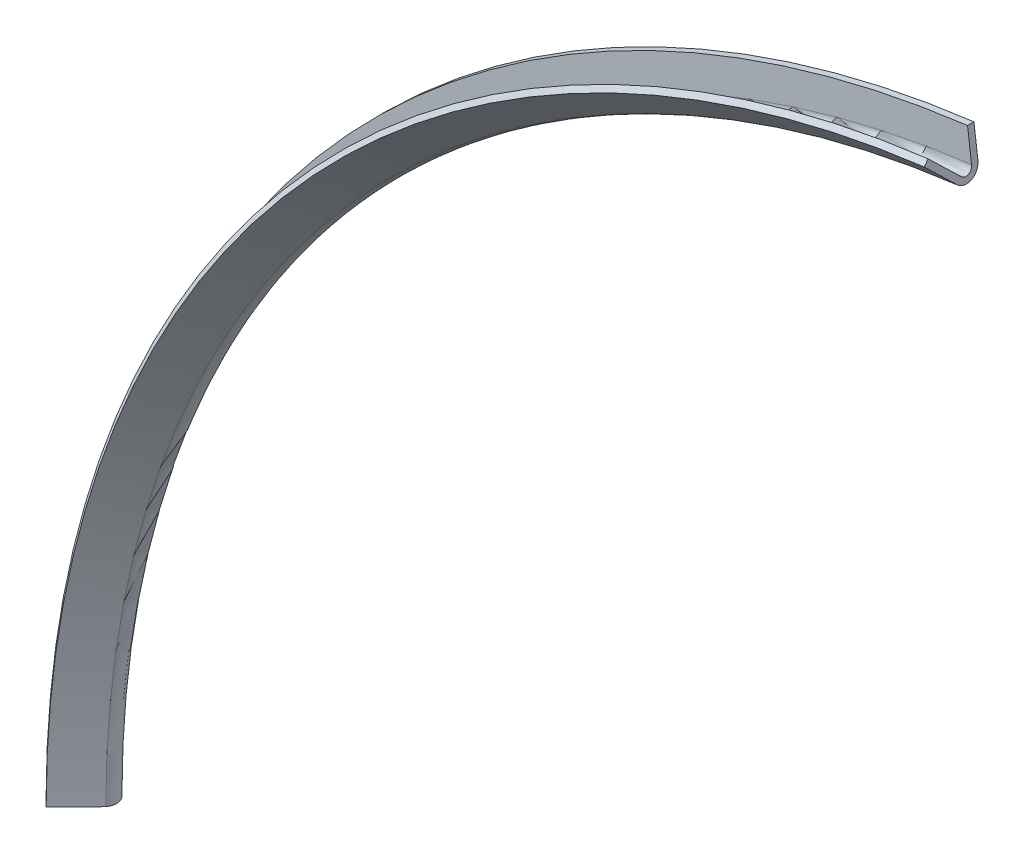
ISO-10303-21;
HEADER;
FILE_DESCRIPTION(('STEP AP214'),'2;1');
FILE_NAME('part.step','',(''),(''),'','','');
FILE_SCHEMA(('AUTOMOTIVE_DESIGN { 1 0 10303 214 1 1 1 1 }'));
ENDSEC;
DATA;
#1=APPLICATION_CONTEXT('core data for automotive mechanical design processes');
#2=APPLICATION_PROTOCOL_DEFINITION('international standard','automotive_design',2000,#1);
#3=PRODUCT_CONTEXT('',#1,'mechanical');
#4=PRODUCT('Part','Part','',(#3));
#5=PRODUCT_RELATED_PRODUCT_CATEGORY('part','',(#4));
#6=PRODUCT_DEFINITION_FORMATION('','',#4);
#7=PRODUCT_DEFINITION_CONTEXT('part definition',#1,'design');
#8=PRODUCT_DEFINITION('design','',#6,#7);
#9=PRODUCT_DEFINITION_SHAPE('','',#8);
#10=(LENGTH_UNIT() NAMED_UNIT(*) SI_UNIT(.MILLI.,.METRE.));
#11=(NAMED_UNIT(*) PLANE_ANGLE_UNIT() SI_UNIT($,.RADIAN.));
#12=(NAMED_UNIT(*) SI_UNIT($,.STERADIAN.) SOLID_ANGLE_UNIT());
#13=UNCERTAINTY_MEASURE_WITH_UNIT(LENGTH_MEASURE(1.E-05),#10,'distance_accuracy_value','');
#14=(GEOMETRIC_REPRESENTATION_CONTEXT(3) GLOBAL_UNCERTAINTY_ASSIGNED_CONTEXT((#13)) GLOBAL_UNIT_ASSIGNED_CONTEXT((#10,
#11,#12)) REPRESENTATION_CONTEXT('',''));
#15=CARTESIAN_POINT('',(0.,0.,0.));
#16=DIRECTION('',(0.,0.,1.));
#17=DIRECTION('',(1.,0.,0.));
#18=AXIS2_PLACEMENT_3D('',#15,#16,#17);
#19=CARTESIAN_POINT('',(-153.036376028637,0.,2.03605110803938));
#20=DIRECTION('',(0.,-1.,0.));
#21=DIRECTION('',(0.,0.,-1.));
#22=AXIS2_PLACEMENT_3D('',#19,#20,#21);
#23=PLANE('',#22);
#24=DIRECTION('',(-1.,0.,0.));
#25=VECTOR('',#24,1.);
#26=CARTESIAN_POINT('',(-158.,0.,0.));
#27=LINE('',#26,#25);
#28=CARTESIAN_POINT('',(-153.,0.,0.));
#29=VERTEX_POINT('',#28);
#30=CARTESIAN_POINT('',(-158.,0.,0.));
#31=VERTEX_POINT('',#30);
#32=EDGE_CURVE('E71',#29,#31,#27,.T.);
#33=ORIENTED_EDGE('',*,*,#32,.F.);
#34=CARTESIAN_POINT('',(-153.036376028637,0.,2.03605110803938));
#35=DIRECTION('',(0.,1.,0.));
#36=DIRECTION('',(0.,0.,-1.));
#37=AXIS2_PLACEMENT_3D('',#34,#35,#36);
#38=CIRCLE('',#37,2.0363760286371);
#39=CARTESIAN_POINT('',(-151.42922340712,0.,3.28660609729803));
#40=VERTEX_POINT('',#39);
#41=EDGE_CURVE('E76',#40,#29,#38,.T.);
#42=ORIENTED_EDGE('',*,*,#41,.F.);
#43=DIRECTION('',(0.696587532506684,0.,-0.717471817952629));
#44=VECTOR('',#43,1.);
#45=CARTESIAN_POINT('',(-156.005407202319,0.,7.99998776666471));
#46=LINE('',#45,#44);
#47=CARTESIAN_POINT('',(-156.005407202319,0.,7.99998776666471));
#48=VERTEX_POINT('',#47);
#49=EDGE_CURVE('E141',#48,#40,#46,.T.);
#50=ORIENTED_EDGE('',*,*,#49,.F.);
#51=DIRECTION('',(0.717471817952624,0.,0.696587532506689));
#52=VECTOR('',#51,1.);
#53=CARTESIAN_POINT('',(-156.005407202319,0.,7.99998776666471));
#54=LINE('',#53,#52);
#55=CARTESIAN_POINT('',(-156.722879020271,0.,7.30340023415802));
#56=VERTEX_POINT('',#55);
#57=EDGE_CURVE('E133',#56,#48,#54,.T.);
#58=ORIENTED_EDGE('',*,*,#57,.F.);
#59=DIRECTION('',(-0.696587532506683,0.,0.717471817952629));
#60=VECTOR('',#59,1.);
#61=CARTESIAN_POINT('',(-156.722879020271,0.,7.30340023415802));
#62=LINE('',#61,#60);
#63=CARTESIAN_POINT('',(-152.143048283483,0.,2.58626228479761));
#64=VERTEX_POINT('',#63);
#65=EDGE_CURVE('E124',#64,#56,#62,.T.);
#66=ORIENTED_EDGE('',*,*,#65,.F.);
#67=CARTESIAN_POINT('',(-152.947550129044,0.,1.99627290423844));
#68=DIRECTION('',(0.,-1.,0.));
#69=DIRECTION('',(0.,0.,1.));
#70=AXIS2_PLACEMENT_3D('',#67,#68,#69);
#71=CIRCLE('',#70,0.997652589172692);
#72=CARTESIAN_POINT('',(-153.,0.,1.));
#73=VERTEX_POINT('',#72);
#74=EDGE_CURVE('E103',#73,#64,#71,.T.);
#75=ORIENTED_EDGE('',*,*,#74,.F.);
#76=DIRECTION('',(1.,0.,0.));
#77=VECTOR('',#76,1.);
#78=CARTESIAN_POINT('',(-158.,0.,1.));
#79=LINE('',#78,#77);
#80=CARTESIAN_POINT('',(-158.,0.,1.));
#81=VERTEX_POINT('',#80);
#82=EDGE_CURVE('E101',#81,#73,#79,.T.);
#83=ORIENTED_EDGE('',*,*,#82,.F.);
#84=DIRECTION('',(0.,0.,1.));
#85=VECTOR('',#84,1.);
#86=CARTESIAN_POINT('',(-158.,0.,0.));
#87=LINE('',#86,#85);
#88=EDGE_CURVE('E65',#31,#81,#87,.T.);
#89=ORIENTED_EDGE('',*,*,#88,.F.);
#90=EDGE_LOOP('',(#33,#42,#50,#58,#66,#75,#83,#89));
#91=FACE_BOUND('',#90,.T.);
#92=ADVANCED_FACE('F34',(#91),#23,.T.);
#93=CARTESIAN_POINT('',(-18.7998284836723,151.877249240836,2.03605110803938));
#94=DIRECTION('',(-0.992425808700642,-0.122845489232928,0.));
#95=DIRECTION('',(0.,0.,-1.));
#96=AXIS2_PLACEMENT_3D('',#93,#94,#95);
#97=PLANE('',#96);
#98=DIRECTION('',(-0.122845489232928,0.992425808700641,0.));
#99=VECTOR('',#98,1.);
#100=CARTESIAN_POINT('',(-19.4095872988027,156.803277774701,0.));
#101=LINE('',#100,#99);
#102=CARTESIAN_POINT('',(-18.795359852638,151.841148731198,0.));
#103=VERTEX_POINT('',#102);
#104=CARTESIAN_POINT('',(-19.4095872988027,156.803277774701,0.));
#105=VERTEX_POINT('',#104);
#106=EDGE_CURVE('E47',#103,#105,#101,.T.);
#107=ORIENTED_EDGE('',*,*,#106,.T.);
#108=DIRECTION('',(0.,0.,1.));
#109=VECTOR('',#108,1.);
#110=CARTESIAN_POINT('',(-19.4095872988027,156.803277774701,0.));
#111=LINE('',#110,#109);
#112=CARTESIAN_POINT('',(-19.4095872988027,156.803277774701,1.));
#113=VERTEX_POINT('',#112);
#114=EDGE_CURVE('E11',#105,#113,#111,.T.);
#115=ORIENTED_EDGE('',*,*,#114,.T.);
#116=DIRECTION('',(0.122845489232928,-0.992425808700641,0.));
#117=VECTOR('',#116,1.);
#118=CARTESIAN_POINT('',(-19.4095872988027,156.803277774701,1.));
#119=LINE('',#118,#117);
#120=CARTESIAN_POINT('',(-18.795359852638,151.841148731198,1.));
#121=VERTEX_POINT('',#120);
#122=EDGE_CURVE('E117',#113,#121,#119,.T.);
#123=ORIENTED_EDGE('',*,*,#122,.T.);
#124=CARTESIAN_POINT('',(-18.7889166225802,151.789096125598,1.99627290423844));
#125=DIRECTION('',(-0.992425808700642,-0.122845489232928,0.));
#126=DIRECTION('',(0.,0.,1.));
#127=AXIS2_PLACEMENT_3D('',#124,#125,#126);
#128=CIRCLE('',#127,0.997652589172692);
#129=CARTESIAN_POINT('',(-18.6900871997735,150.990687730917,2.58626228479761));
#130=VERTEX_POINT('',#129);
#131=EDGE_CURVE('E125',#121,#130,#128,.T.);
#132=ORIENTED_EDGE('',*,*,#131,.T.);
#133=DIRECTION('',(-0.0855726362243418,0.691311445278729,0.717471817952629));
#134=VECTOR('',#133,1.);
#135=CARTESIAN_POINT('',(-19.2526987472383,155.535829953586,7.30340023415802));
#136=LINE('',#135,#134);
#137=CARTESIAN_POINT('',(-19.2526987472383,155.535829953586,7.30340023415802));
#138=VERTEX_POINT('',#137);
#139=EDGE_CURVE('E130',#130,#138,#136,.T.);
#140=ORIENTED_EDGE('',*,*,#139,.T.);
#141=DIRECTION('',(0.0881381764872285,-0.712037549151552,0.696587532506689));
#142=VECTOR('',#141,1.);
#143=CARTESIAN_POINT('',(-19.164560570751,154.823792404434,7.99998776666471));
#144=LINE('',#143,#142);
#145=CARTESIAN_POINT('',(-19.164560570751,154.823792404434,7.99998776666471));
#146=VERTEX_POINT('',#145);
#147=EDGE_CURVE('E138',#138,#146,#144,.T.);
#148=ORIENTED_EDGE('',*,*,#147,.T.);
#149=DIRECTION('',(0.0855726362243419,-0.69131144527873,-0.717471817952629));
#150=VECTOR('',#149,1.);
#151=CARTESIAN_POINT('',(-19.164560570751,154.823792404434,7.99998776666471));
#152=LINE('',#151,#150);
#153=CARTESIAN_POINT('',(-18.6023970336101,150.282269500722,3.28660609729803));
#154=VERTEX_POINT('',#153);
#155=EDGE_CURVE('E146',#146,#154,#152,.T.);
#156=ORIENTED_EDGE('',*,*,#155,.T.);
#157=CARTESIAN_POINT('',(-18.7998284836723,151.877249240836,2.03605110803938));
#158=DIRECTION('',(0.992425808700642,0.122845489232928,0.));
#159=DIRECTION('',(0.,0.,-1.));
#160=AXIS2_PLACEMENT_3D('',#157,#158,#159);
#161=CIRCLE('',#160,2.0363760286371);
#162=EDGE_CURVE('E53',#154,#103,#161,.T.);
#163=ORIENTED_EDGE('',*,*,#162,.T.);
#164=EDGE_LOOP('',(#107,#115,#123,#132,#140,#148,#156,#163));
#165=FACE_BOUND('',#164,.T.);
#166=ADVANCED_FACE('F180',(#165),#97,.F.);
#167=CARTESIAN_POINT('',(-158.,0.,1.));
#168=DIRECTION('',(0.,0.,1.));
#169=DIRECTION('',(1.,0.,0.));
#170=AXIS2_PLACEMENT_3D('',#167,#168,#169);
#171=PLANE('',#170);
#172=CARTESIAN_POINT('',(0.,0.,1.));
#173=DIRECTION('',(0.,0.,-1.));
#174=DIRECTION('',(-1.,0.,0.));
#175=AXIS2_PLACEMENT_3D('',#172,#173,#174);
#176=CIRCLE('',#175,153.);
#177=EDGE_CURVE('E119',#73,#121,#176,.T.);
#178=ORIENTED_EDGE('',*,*,#177,.T.);
#179=ORIENTED_EDGE('',*,*,#122,.F.);
#180=CARTESIAN_POINT('',(0.,0.,1.));
#181=DIRECTION('',(0.,0.,-1.));
#182=DIRECTION('',(-1.,0.,0.));
#183=AXIS2_PLACEMENT_3D('',#180,#181,#182);
#184=CIRCLE('',#183,158.);
#185=EDGE_CURVE('E113',#81,#113,#184,.T.);
#186=ORIENTED_EDGE('',*,*,#185,.F.);
#187=ORIENTED_EDGE('',*,*,#82,.T.);
#188=EDGE_LOOP('',(#178,#179,#186,#187));
#189=FACE_BOUND('',#188,.T.);
#190=ADVANCED_FACE('F116',(#189),#171,.T.);
#191=CARTESIAN_POINT('',(0.,0.,1.99627290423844));
#192=DIRECTION('',(0.,0.,-1.));
#193=DIRECTION('',(-1.,0.,0.));
#194=AXIS2_PLACEMENT_3D('',#191,#192,#193);
#195=TOROIDAL_SURFACE('',#194,152.947550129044,0.997652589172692);
#196=CARTESIAN_POINT('',(0.,0.,2.58626228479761));
#197=DIRECTION('',(0.,0.,-1.));
#198=DIRECTION('',(-1.,0.,0.));
#199=AXIS2_PLACEMENT_3D('',#196,#197,#198);
#200=CIRCLE('',#199,152.143048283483);
#201=EDGE_CURVE('E127',#64,#130,#200,.T.);
#202=ORIENTED_EDGE('',*,*,#201,.T.);
#203=ORIENTED_EDGE('',*,*,#131,.F.);
#204=ORIENTED_EDGE('',*,*,#177,.F.);
#205=ORIENTED_EDGE('',*,*,#74,.T.);
#206=EDGE_LOOP('',(#202,#203,#204,#205));
#207=FACE_BOUND('',#206,.T.);
#208=ADVANCED_FACE('F178',(#207),#195,.F.);
#209=CARTESIAN_POINT('',(0.,0.,2.5862622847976));
#210=DIRECTION('',(0.,0.,1.));
#211=DIRECTION('',(1.,0.,0.));
#212=AXIS2_PLACEMENT_3D('',#209,#210,#211);
#213=CONICAL_SURFACE('',#212,152.143048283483,0.770630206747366);
#214=CARTESIAN_POINT('',(0.,0.,7.30340023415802));
#215=DIRECTION('',(0.,0.,-1.));
#216=DIRECTION('',(-1.,0.,0.));
#217=AXIS2_PLACEMENT_3D('',#214,#215,#216);
#218=CIRCLE('',#217,156.722879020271);
#219=EDGE_CURVE('E135',#56,#138,#218,.T.);
#220=ORIENTED_EDGE('',*,*,#219,.T.);
#221=ORIENTED_EDGE('',*,*,#139,.F.);
#222=ORIENTED_EDGE('',*,*,#201,.F.);
#223=ORIENTED_EDGE('',*,*,#65,.T.);
#224=EDGE_LOOP('',(#220,#221,#222,#223));
#225=FACE_BOUND('',#224,.T.);
#226=ADVANCED_FACE('F175',(#225),#213,.T.);
#227=CARTESIAN_POINT('',(0.,0.,7.30340023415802));
#228=DIRECTION('',(0.,0.,-1.));
#229=DIRECTION('',(-1.,0.,0.));
#230=AXIS2_PLACEMENT_3D('',#227,#228,#229);
#231=CONICAL_SURFACE('',#230,156.722879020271,0.800166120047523);
#232=CARTESIAN_POINT('',(0.,0.,7.99998776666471));
#233=DIRECTION('',(0.,0.,-1.));
#234=DIRECTION('',(-1.,0.,0.));
#235=AXIS2_PLACEMENT_3D('',#232,#233,#234);
#236=CIRCLE('',#235,156.005407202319);
#237=EDGE_CURVE('E143',#48,#146,#236,.T.);
#238=ORIENTED_EDGE('',*,*,#237,.T.);
#239=ORIENTED_EDGE('',*,*,#147,.F.);
#240=ORIENTED_EDGE('',*,*,#219,.F.);
#241=ORIENTED_EDGE('',*,*,#57,.T.);
#242=EDGE_LOOP('',(#238,#239,#240,#241));
#243=FACE_BOUND('',#242,.T.);
#244=ADVANCED_FACE('F171',(#243),#231,.T.);
#245=CARTESIAN_POINT('',(0.,0.,7.99998776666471));
#246=DIRECTION('',(0.,0.,1.));
#247=DIRECTION('',(1.,0.,0.));
#248=AXIS2_PLACEMENT_3D('',#245,#246,#247);
#249=CONICAL_SURFACE('',#248,156.005407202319,0.770630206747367);
#250=CARTESIAN_POINT('',(0.,0.,3.28660609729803));
#251=DIRECTION('',(0.,0.,-1.));
#252=DIRECTION('',(-1.,0.,0.));
#253=AXIS2_PLACEMENT_3D('',#250,#251,#252);
#254=CIRCLE('',#253,151.42922340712);
#255=EDGE_CURVE('E149',#40,#154,#254,.T.);
#256=ORIENTED_EDGE('',*,*,#255,.T.);
#257=ORIENTED_EDGE('',*,*,#155,.F.);
#258=ORIENTED_EDGE('',*,*,#237,.F.);
#259=ORIENTED_EDGE('',*,*,#49,.T.);
#260=EDGE_LOOP('',(#256,#257,#258,#259));
#261=FACE_BOUND('',#260,.T.);
#262=ADVANCED_FACE('F167',(#261),#249,.F.);
#263=CARTESIAN_POINT('',(0.,0.,2.03605110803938));
#264=DIRECTION('',(0.,0.,-1.));
#265=DIRECTION('',(-1.,0.,0.));
#266=AXIS2_PLACEMENT_3D('',#263,#264,#265);
#267=TOROIDAL_SURFACE('',#266,153.036376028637,2.0363760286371);
#268=CARTESIAN_POINT('',(0.,0.,0.));
#269=DIRECTION('',(0.,0.,-1.));
#270=DIRECTION('',(-1.,0.,0.));
#271=AXIS2_PLACEMENT_3D('',#268,#269,#270);
#272=CIRCLE('',#271,153.);
#273=EDGE_CURVE('E154',#29,#103,#272,.T.);
#274=ORIENTED_EDGE('',*,*,#273,.T.);
#275=ORIENTED_EDGE('',*,*,#162,.F.);
#276=ORIENTED_EDGE('',*,*,#255,.F.);
#277=ORIENTED_EDGE('',*,*,#41,.T.);
#278=EDGE_LOOP('',(#274,#275,#276,#277));
#279=FACE_BOUND('',#278,.T.);
#280=ADVANCED_FACE('F163',(#279),#267,.T.);
#281=CARTESIAN_POINT('',(-158.,0.,0.));
#282=DIRECTION('',(0.,0.,-1.));
#283=DIRECTION('',(-1.,0.,0.));
#284=AXIS2_PLACEMENT_3D('',#281,#282,#283);
#285=PLANE('',#284);
#286=CARTESIAN_POINT('',(0.,0.,0.));
#287=DIRECTION('',(0.,0.,-1.));
#288=DIRECTION('',(-1.,0.,0.));
#289=AXIS2_PLACEMENT_3D('',#286,#287,#288);
#290=CIRCLE('',#289,158.);
#291=EDGE_CURVE('E41',#31,#105,#290,.T.);
#292=ORIENTED_EDGE('',*,*,#291,.T.);
#293=ORIENTED_EDGE('',*,*,#106,.F.);
#294=ORIENTED_EDGE('',*,*,#273,.F.);
#295=ORIENTED_EDGE('',*,*,#32,.T.);
#296=EDGE_LOOP('',(#292,#293,#294,#295));
#297=FACE_BOUND('',#296,.T.);
#298=ADVANCED_FACE('F160',(#297),#285,.T.);
#299=CARTESIAN_POINT('',(0.,0.,0.));
#300=DIRECTION('',(0.,0.,-1.));
#301=DIRECTION('',(-1.,0.,0.));
#302=AXIS2_PLACEMENT_3D('',#299,#300,#301);
#303=CYLINDRICAL_SURFACE('',#302,158.);
#304=ORIENTED_EDGE('',*,*,#114,.F.);
#305=ORIENTED_EDGE('',*,*,#291,.F.);
#306=ORIENTED_EDGE('',*,*,#88,.T.);
#307=ORIENTED_EDGE('',*,*,#185,.T.);
#308=EDGE_LOOP('',(#304,#305,#306,#307));
#309=FACE_BOUND('',#308,.T.);
#310=ADVANCED_FACE('F112',(#309),#303,.T.);
#311=CLOSED_SHELL('',(#92,#166,#190,#208,#226,#244,#262,#280,#298,#310));
#312=MANIFOLD_SOLID_BREP('B2',#311);
#313=ADVANCED_BREP_SHAPE_REPRESENTATION('',(#18,#312),#14);
#314=SHAPE_DEFINITION_REPRESENTATION(#9,#313);
ENDSEC;
END-ISO-10303-21;
